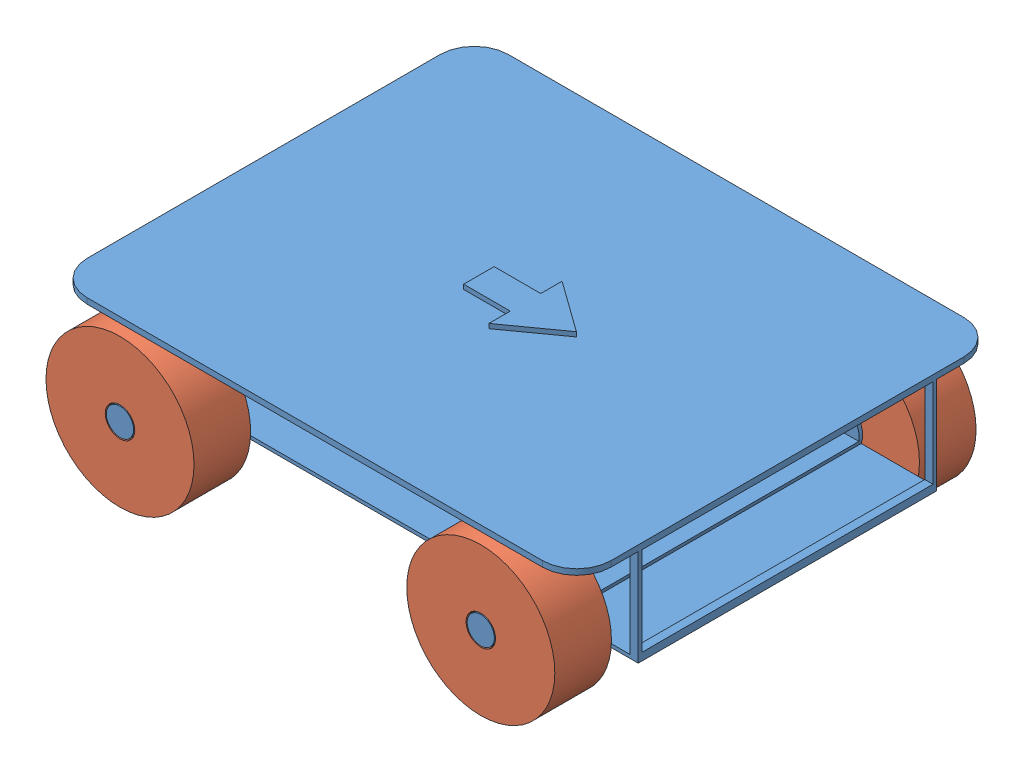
SolidWorks assembly robot.SLDASM, configuration Default (file format 15000). Lengths in mm.
Overall size (233.08 74.5 185).
5 component instances, 2 part files, 8 mates.
Components (placement in the parent):
- chassis-1: chassis.SLDPRT [Default] at (56.2417 117.9638 193.5715) size (230 48 185)
- wheel-1: wheel.SLDPRT [Default] at (129.1054 122.9638 273.6367) size (65 65 24.87)
- wheel-2: wheel.SLDPRT [Default] at (129.1054 122.9638 113.5063) size (65 65 24.87)
- wheel-3: wheel.SLDPRT [Default] at (-29.3369 122.9638 273.6367) size (65 65 24.87)
- wheel-4: wheel.SLDPRT [Default] at (-29.3369 122.9638 113.5063) size (65 65 24.87)
Mates (geometry in assembly coordinates):
- Concentric1: concentric aligned: cylinder of chassis-1 through (129.1054 122.9638 286.0715) axis (0 0 -1) radius 6; cylinder of wheel-1 through (129.1054 122.9638 184.6467) axis (0 0 -1) radius 6.5
- Coincident1: coincident aligned: plane of chassis-1 through (-58.7583 162.9638 286.0715) normal (0 0 1); plane of wheel-1 through (129.1054 129.4638 286.0715) normal (0 0 1)
- Concentric2: concentric anti-aligned: cylinder of chassis-1 through (129.1054 122.9638 101.0715) axis (0 0 1) radius 6; cylinder of wheel-2 through (129.1054 122.9638 24.5163) axis (0 0 -1) radius 6.5
- Coincident2: coincident aligned: plane of chassis-1 through (-58.7583 162.9638 101.0715) normal (0 0 -1); plane of wheel-2 through (129.1054 129.4638 101.0715) normal (0 0 -1)
- Concentric3: concentric aligned: cylinder of chassis-1 through (-29.3369 122.9638 286.0715) axis (0 0 -1) radius 6; cylinder of wheel-3 through (-29.3369 122.9638 184.6467) axis (0 0 -1) radius 6.5
- Coincident3: coincident aligned: plane of chassis-1 through (-58.7583 162.9638 286.0715) normal (0 0 1); plane of wheel-3 through (-29.3369 129.4638 286.0715) normal (0 0 1)
- Concentric4: concentric anti-aligned: cylinder of chassis-1 through (-29.3369 122.9638 101.0715) axis (0 0 1) radius 6; cylinder of wheel-4 through (-29.3369 122.9638 24.5163) axis (0 0 -1) radius 6.5
- Coincident4: coincident aligned: plane of chassis-1 through (-58.7583 162.9638 101.0715) normal (0 0 -1); plane of wheel-4 through (-29.3369 129.4638 101.0715) normal (0 0 -1)
